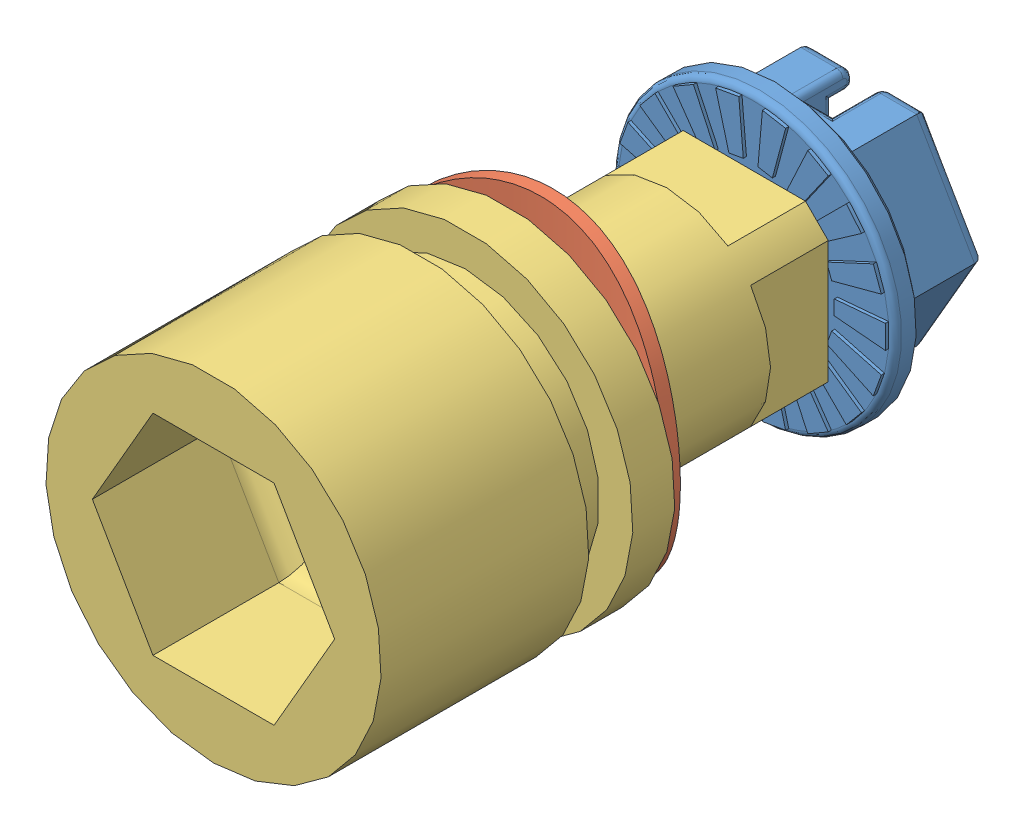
SolidWorks assembly 1000-U96 10mm HEX CHROME INSERT.sldasm, configuration Default (file format 6000). Lengths in mm.
Overall size (16 16 31.27).
3 component instances, 3 part files, 0 mates.
Components (placement in the parent):
- 1000-277-01_PRT-1: 1000-277-01_PRT.sldprt [Default] at (0 0 -11.75) x (0 0 -1) z (0 1 0) size (15.52 13.5 13.5)
- 1000-03_PRT-1: 1000-03_PRT.sldprt [Default] x (1 0 0) z (0 1 0) size (15.2 2.68 15.2)
- 1000-175-1: 1000-175.sldprt [Default] x (1 0 0) z (0 -1 0) size (16 25.3 16)
